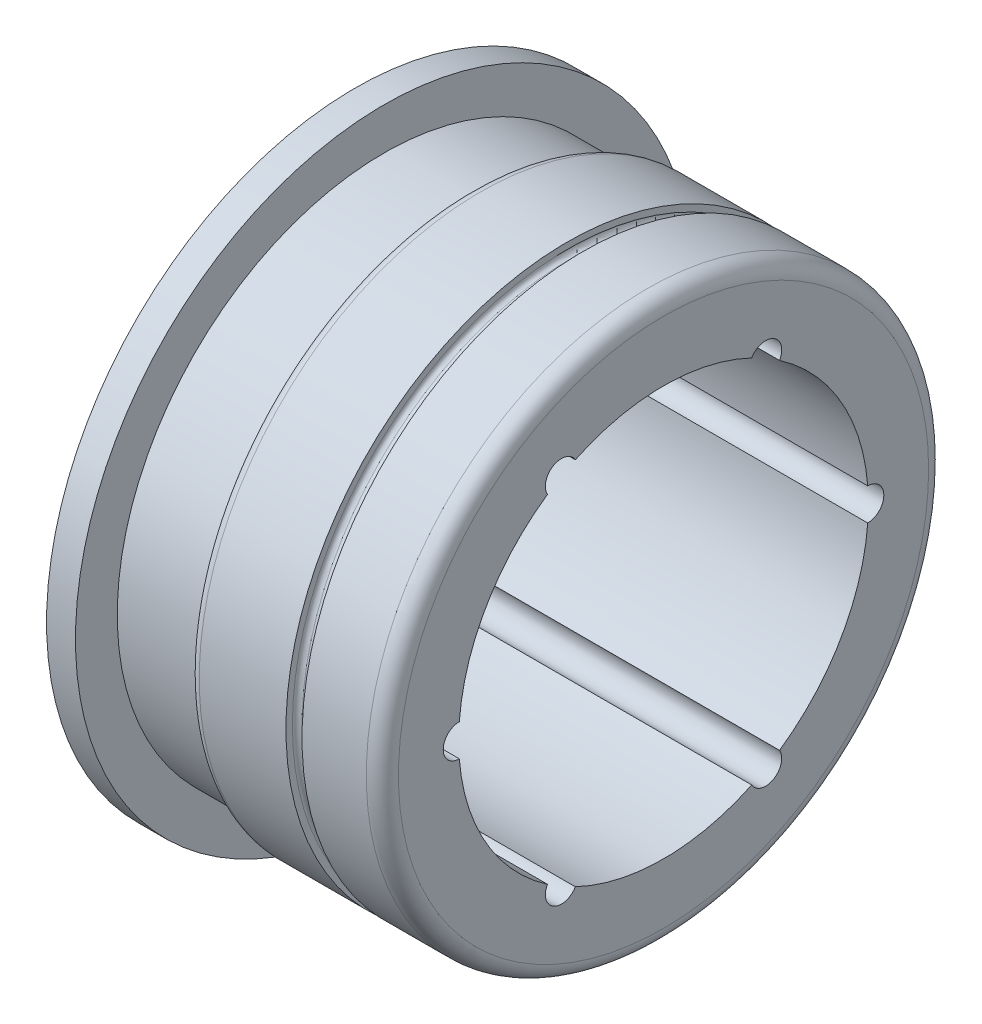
from build123d import *

# Parameters (mm, degrees)
ENL_V_MAT_EXTRU_1_DEPTH      = 34.255375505
R_P_TITION_CIRCULAIRE1_COUNT = 6


with BuildPart() as part:
    # Esquisse1 → Base-R_volution (revolve)
    with BuildSketch(Plane.XY, mode=Mode.PRIVATE) as base_r_volution_sk:
        with BuildLine():
            Line((22.6, 17.5), (28, 17.5))
            Line((28, 17.5), (28, 17.1))
            ThreePointArc((28, 17.1), (28.087867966, 16.887867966), (28.3, 16.8))
            Line((28.3, 16.8), (28.7, 16.8))
            ThreePointArc((28.7, 16.8), (28.912132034, 16.887867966), (29, 17.1))
            Line((29, 17.1), (29, 17.5))
            Line((29, 17.5), (33, 17.5))
            ThreePointArc((33, 17.5), (33.707106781, 17.207106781), (34, 16.5))
            Line((34, 16.5), (34, 12.75))
            Line((34, 12.75), (14.8, 12.75))
            Line((14.8, 12.75), (14.8, 19.2))
            Line((14.8, 19.2), (16.6, 19.2))
            Line((16.6, 19.2), (16.6, 16.6))
            Line((16.6, 16.6), (22, 16.6))
            Line((22, 16.6), (22, 16.9))
            ThreePointArc((22, 16.9), (22.175735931, 17.324264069), (22.6, 17.5))
        make_face()
    revolve(base_r_volution_sk.sketch.rotate(Axis((71, 0, 0), (-1, 0, 0)), 90), axis=Axis((71, 0, 0), (-1, 0, 0)))

    # Esquisse2 → Enl_v. mat.-Extru.1 (cut, through all)
    with BuildSketch(Plane.ZY.offset(-14.8)):
        with BuildLine():
            Line((11, 1), (12.710723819, 1))
            ThreePointArc((12.710723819, 1), (13.710723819, 0), (12.710723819, -1))
            Line((12.710723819, -1), (11, -1))
            Line((11, -1), (11, 1))
        make_face()
    enl_v_mat_extru_1 = extrude(amount=-ENL_V_MAT_EXTRU_1_DEPTH, mode=Mode.SUBTRACT)

    # R_p_tition circulaire1: Enl_v. mat.-Extru.1 ×6 about axis
    r_p_tition_circulaire1_axis = Axis((21, 0, 0), (1, 0, 0))
    for i in range(1, R_P_TITION_CIRCULAIRE1_COUNT):
        add(enl_v_mat_extru_1.rotate(r_p_tition_circulaire1_axis, i * 360 / R_P_TITION_CIRCULAIRE1_COUNT), mode=Mode.SUBTRACT)


solid = part.part
